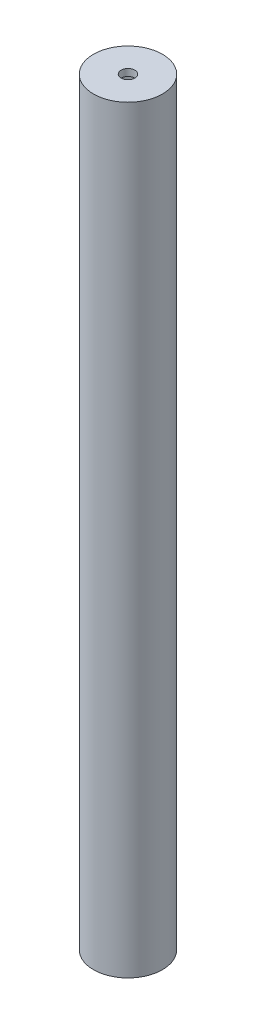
from build123d import *


with BuildPart() as part:
    # Sketch1 → Revolve1 (revolve)
    with BuildSketch(Plane.XY):
        Polygon((-51.266785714, 355.492142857), (-66.266785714, 355.492142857), (-66.266785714, -194.507857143), (-51.266785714, -194.507857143), (-51.266785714, -189.507857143), (-61.266785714, -189.507857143), (-61.266785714, 350.492142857), (-51.266785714, 350.492142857), (-46.265181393, 350.492142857), (-46.266785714, 355.492142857), align=None)
    revolve(axis=Axis((-41.266785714, 300.492142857, 0), (0, -1, 0)))


solid = part.part
